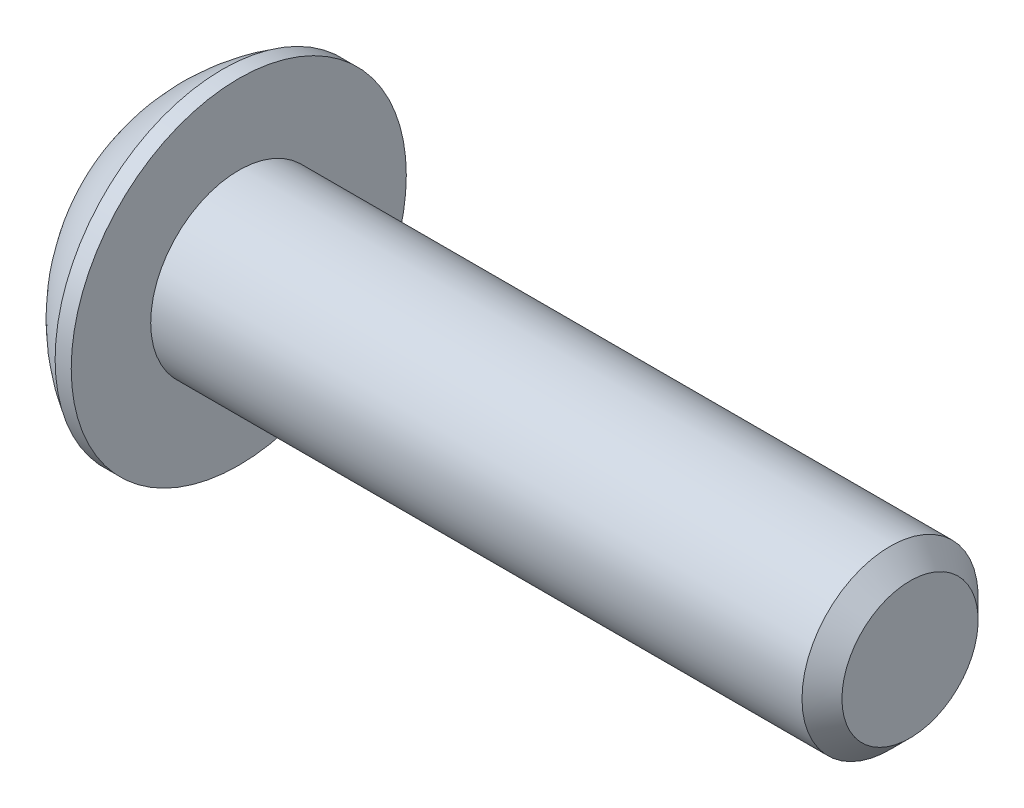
from build123d import *

# Parameters (mm, degrees)
HEX_2_DEPTH = 1.3208


with BuildPart() as part:
    # BodySke → BaseBody (revolve)
    with BuildSketch(Plane.XY, mode=Mode.PRIVATE) as basebody_sk:
        with BuildLine():
            Line((18.0848, 0), (18.0848, 1.61036))
            Line((18.0848, 1.61036), (17.61236, 2.0828))
            Line((17.61236, 2.0828), (2.2098, 2.0828))
            Line((2.2098, 2.0828), (2.2098, 3.9624))
            Line((2.2098, 3.9624), (1.8288, 3.9624))
            ThreePointArc((1.8288, 3.9624), (0.765445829, 3.109296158), (0, 1.9812))
            Line((0, 1.9812), (0, 0))
            Line((0, 0), (18.0848, 0))
        make_face()
    revolve(basebody_sk.sketch.rotate(Axis((0, 0, 0), (1, 0, 0)), 90), axis=Axis((0, 0, 0), (1, 0, 0)))

    # Sketch2 → PreBroach (revolve, cut)
    with BuildSketch(Plane.XY, mode=Mode.PRIVATE) as prebroach_sk:
        Polygon((0, 1.1938), (1.3208, 1.1938), (2.010040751, 0), (0, 0), align=None)
    revolve(prebroach_sk.sketch.rotate(Axis((0, 0, 0), (1, 0, 0)), 90), axis=Axis((0, 0, 0), (1, 0, 0)), mode=Mode.SUBTRACT)

    # Sketch3 → Hex 2 (cut)
    with BuildSketch(Plane(origin=(0, 0, 0), x_dir=(0, 0, -1), z_dir=(1, 0, 0))):
        Polygon((-1.1938, -0.689240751), (-1.1938, 0.689240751), (0, 1.378481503), (1.1938, 0.689240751), (1.1938, -0.689240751), (0, -1.378481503), align=None)
    extrude(amount=HEX_2_DEPTH, mode=Mode.SUBTRACT)


solid = part.part
